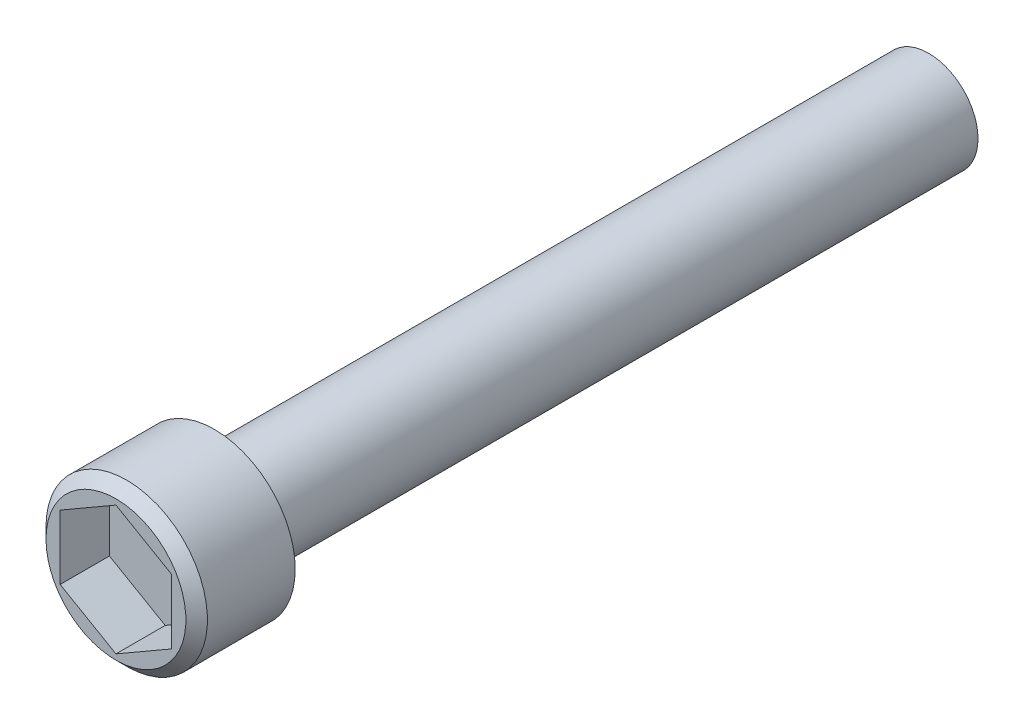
from build123d import *

# Parameters (mm, degrees)
SKETCH1_R     = 1.7526
SHANK_DEPTH   = 25.4
SKETCH2_R     = 2.8702
CAP_DEPTH     = 3.5052
FILLET1_R     = 0.254
HEXCUT_DEPTH  = 1.7526
CHAMFER1_SIZE = 0.382693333


with BuildPart() as part:
    # Sketch1 → Shank (new body)
    with BuildSketch(Plane.XY):
        Circle(SKETCH1_R)
    extrude(amount=SHANK_DEPTH)

    # Sketch2 → Cap (add)
    with BuildSketch(Plane.XY.offset(25.4)):
        Circle(SKETCH2_R)
    extrude(amount=CAP_DEPTH)

    # Fillet1
    fillet1_edges = [part.edges().sort_by_distance(p)[0] for p in [
        (-1.7526, 0, 25.4),
    ]]
    fillet(fillet1_edges, radius=FILLET1_R)

    # Sketch3 → HexCut (cut)
    with BuildSketch(Plane(origin=(4.874850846, 0.925692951, 28.9052), x_dir=(1, 0, 0), z_dir=(0, 0, 1))):
        Polygon((-4.874850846, 1.36566593), (-2.890475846, 0.219986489), (-2.890475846, -2.071372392), (-4.874850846, -3.217051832), (-6.859225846, -2.071372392), (-6.859225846, 0.219986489), align=None)
    extrude(amount=-HEXCUT_DEPTH, mode=Mode.SUBTRACT)

    # Chamfer1
    chamfer1_edges = [part.edges().sort_by_distance(p)[0] for p in [
        (-2.8702, 0, 28.9052),
    ]]
    chamfer(chamfer1_edges, length=CHAMFER1_SIZE)


solid = part.part
